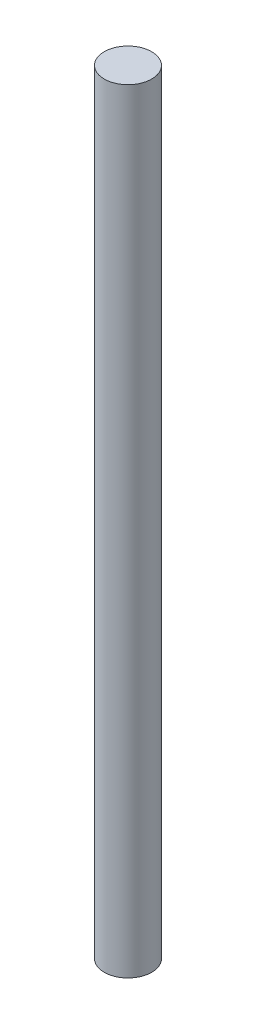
from build123d import *

# Parameters (mm, degrees)
SKETCH1_R           = 12.065
BOSS_EXTRUDE1_DEPTH = 393.7


with BuildPart() as part:
    # Sketch1 → Boss-Extrude1 (new body)
    with BuildSketch(Plane(origin=(0, 0, 0), x_dir=(1, 0, 0), z_dir=(0, 1, 0))):
        with Locations(Location((0, 0, 0), (0, 0, 270))):
            Circle(SKETCH1_R)
    extrude(amount=BOSS_EXTRUDE1_DEPTH)


solid = part.part
